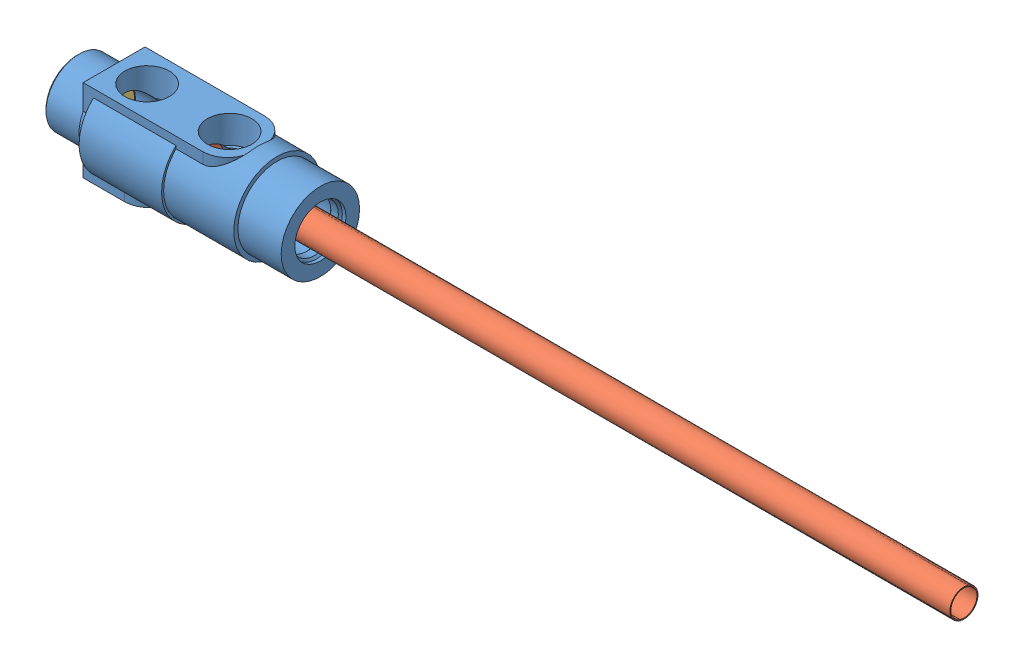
SolidWorks assembly RLQC3822.SLDASM, configuration Default (file format 13000). Lengths in mm.
Overall size (341.84 34.13 34.92).
4 component instances, 4 part files, 4 mates.
Components (placement in the parent):
- RLQCH3822-1: RLQCH3822.SLDPRT [Default] at origin size (93.65 34.13 34.92)
- PT37-437L12-1: PT37-437L12.SLDPRT [PT37-437L12] at (-57.15 0 0) x (0 0.464275 -0.885691) z (0 -0.885691 -0.464275) size (16.91 304.8 16.91)
- BR50-1: BR50.sldprt [Default] at (-93.6498 0 0) x (0 -0.381849 0.924225) z (0 -0.924225 -0.381849) size (21.25 14 21.25)
- BR37-1: BR37.sldprt [Default] at (-66.675 -15.875 0) x (0.47794 0 -0.878392) z (-0.878392 0 -0.47794) size (17.08 10.47 17.08)
Mates (geometry in assembly coordinates):
- ProfileCenter1: profile center aligned: plane of RLQCH3822-1 through (-93.6498 12.7 0) normal (-1 0 0); circle of BR50-1
- ProfileCenter2: profile center aligned: plane of RLQCH3822-1 through (-39.6875 -15.875 0) normal (0 -1 0); circle of BR37-1
- Distance1: distance = 57.15 mm: plane of RLQCH3822-1 through (0 0 -11.6745) normal (1 0 0); plane of PT37-437L12-1 through (-57.15 0 0) normal (-1 0 0)
- Concentric1: concentric aligned: cylinder of RLQCH3822-1 through (-8.3361 0 0) axis (1 0 0) radius 15.0812; cylinder of PT37-437L12-1 through (-57.15 0 0) axis (1 0 0) radius 5.4229
